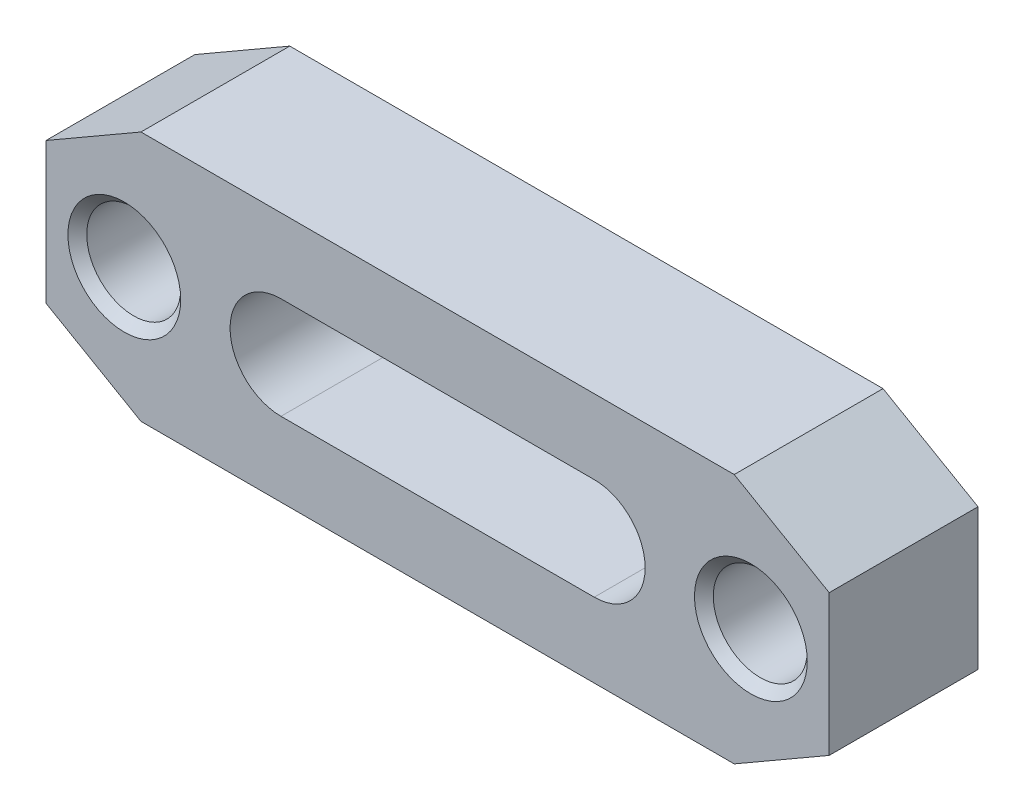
ISO-10303-21;
HEADER;
FILE_DESCRIPTION(('STEP AP214'),'2;1');
FILE_NAME('part.step','',(''),(''),'','','');
FILE_SCHEMA(('AUTOMOTIVE_DESIGN { 1 0 10303 214 1 1 1 1 }'));
ENDSEC;
DATA;
#1=APPLICATION_CONTEXT('core data for automotive mechanical design processes');
#2=APPLICATION_PROTOCOL_DEFINITION('international standard','automotive_design',2000,#1);
#3=PRODUCT_CONTEXT('',#1,'mechanical');
#4=PRODUCT('Part','Part','',(#3));
#5=PRODUCT_RELATED_PRODUCT_CATEGORY('part','',(#4));
#6=PRODUCT_DEFINITION_FORMATION('','',#4);
#7=PRODUCT_DEFINITION_CONTEXT('part definition',#1,'design');
#8=PRODUCT_DEFINITION('design','',#6,#7);
#9=PRODUCT_DEFINITION_SHAPE('','',#8);
#10=(LENGTH_UNIT() NAMED_UNIT(*) SI_UNIT(.MILLI.,.METRE.));
#11=(NAMED_UNIT(*) PLANE_ANGLE_UNIT() SI_UNIT($,.RADIAN.));
#12=(NAMED_UNIT(*) SI_UNIT($,.STERADIAN.) SOLID_ANGLE_UNIT());
#13=UNCERTAINTY_MEASURE_WITH_UNIT(LENGTH_MEASURE(1.E-05),#10,'distance_accuracy_value','');
#14=(GEOMETRIC_REPRESENTATION_CONTEXT(3) GLOBAL_UNCERTAINTY_ASSIGNED_CONTEXT((#13)) GLOBAL_UNIT_ASSIGNED_CONTEXT((#10,
#11,#12)) REPRESENTATION_CONTEXT('',''));
#15=CARTESIAN_POINT('',(0.,0.,0.));
#16=DIRECTION('',(0.,0.,1.));
#17=DIRECTION('',(1.,0.,0.));
#18=AXIS2_PLACEMENT_3D('',#15,#16,#17);
#19=CARTESIAN_POINT('',(50.,-16.,19.));
#20=DIRECTION('',(0.,0.,1.));
#21=DIRECTION('',(1.,0.,0.));
#22=AXIS2_PLACEMENT_3D('',#19,#20,#21);
#23=PLANE('',#22);
#24=CARTESIAN_POINT('',(40.,0.,19.));
#25=DIRECTION('',(0.,0.,-1.));
#26=DIRECTION('',(-1.,0.,0.));
#27=AXIS2_PLACEMENT_3D('',#24,#25,#26);
#28=CIRCLE('',#27,7.2);
#29=CARTESIAN_POINT('',(32.8,0.,19.));
#30=VERTEX_POINT('',#29);
#31=EDGE_CURVE('E212',#30,#30,#28,.T.);
#32=ORIENTED_EDGE('',*,*,#31,.T.);
#33=EDGE_LOOP('',(#32));
#34=FACE_BOUND('',#33,.T.);
#35=CARTESIAN_POINT('',(-40.,0.,19.));
#36=DIRECTION('',(0.,0.,-1.));
#37=DIRECTION('',(-1.,0.,0.));
#38=AXIS2_PLACEMENT_3D('',#35,#36,#37);
#39=CIRCLE('',#38,7.2);
#40=CARTESIAN_POINT('',(-47.2,0.,19.));
#41=VERTEX_POINT('',#40);
#42=EDGE_CURVE('E133',#41,#41,#39,.T.);
#43=ORIENTED_EDGE('',*,*,#42,.T.);
#44=EDGE_LOOP('',(#43));
#45=FACE_BOUND('',#44,.T.);
#46=DIRECTION('',(1.,0.,0.));
#47=VECTOR('',#46,1.);
#48=CARTESIAN_POINT('',(-37.8756443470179,-16.,19.));
#49=LINE('',#48,#47);
#50=CARTESIAN_POINT('',(-37.8756443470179,-16.,19.));
#51=VERTEX_POINT('',#50);
#52=CARTESIAN_POINT('',(37.8756443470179,-16.,19.));
#53=VERTEX_POINT('',#52);
#54=EDGE_CURVE('E143',#51,#53,#49,.T.);
#55=ORIENTED_EDGE('',*,*,#54,.T.);
#56=DIRECTION('',(0.866025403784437,0.5,0.));
#57=VECTOR('',#56,1.);
#58=CARTESIAN_POINT('',(37.8756443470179,-16.,19.));
#59=LINE('',#58,#57);
#60=CARTESIAN_POINT('',(50.,-9.,19.));
#61=VERTEX_POINT('',#60);
#62=EDGE_CURVE('E146',#53,#61,#59,.T.);
#63=ORIENTED_EDGE('',*,*,#62,.T.);
#64=DIRECTION('',(0.,1.,0.));
#65=VECTOR('',#64,1.);
#66=CARTESIAN_POINT('',(50.,-9.,19.));
#67=LINE('',#66,#65);
#68=CARTESIAN_POINT('',(50.,9.,19.));
#69=VERTEX_POINT('',#68);
#70=EDGE_CURVE('E149',#61,#69,#67,.T.);
#71=ORIENTED_EDGE('',*,*,#70,.T.);
#72=DIRECTION('',(-0.866025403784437,0.5,0.));
#73=VECTOR('',#72,1.);
#74=CARTESIAN_POINT('',(37.8756443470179,16.,19.));
#75=LINE('',#74,#73);
#76=CARTESIAN_POINT('',(37.8756443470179,16.,19.));
#77=VERTEX_POINT('',#76);
#78=EDGE_CURVE('E151',#69,#77,#75,.T.);
#79=ORIENTED_EDGE('',*,*,#78,.T.);
#80=DIRECTION('',(-1.,0.,0.));
#81=VECTOR('',#80,1.);
#82=CARTESIAN_POINT('',(-37.8756443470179,16.,19.));
#83=LINE('',#82,#81);
#84=CARTESIAN_POINT('',(-37.8756443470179,16.,19.));
#85=VERTEX_POINT('',#84);
#86=EDGE_CURVE('E153',#77,#85,#83,.T.);
#87=ORIENTED_EDGE('',*,*,#86,.T.);
#88=DIRECTION('',(-0.866025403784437,-0.5,0.));
#89=VECTOR('',#88,1.);
#90=CARTESIAN_POINT('',(-37.8756443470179,16.,19.));
#91=LINE('',#90,#89);
#92=CARTESIAN_POINT('',(-50.,9.,19.));
#93=VERTEX_POINT('',#92);
#94=EDGE_CURVE('E155',#85,#93,#91,.T.);
#95=ORIENTED_EDGE('',*,*,#94,.T.);
#96=DIRECTION('',(0.,-1.,0.));
#97=VECTOR('',#96,1.);
#98=CARTESIAN_POINT('',(-50.,-9.,19.));
#99=LINE('',#98,#97);
#100=CARTESIAN_POINT('',(-50.,-9.,19.));
#101=VERTEX_POINT('',#100);
#102=EDGE_CURVE('E157',#93,#101,#99,.T.);
#103=ORIENTED_EDGE('',*,*,#102,.T.);
#104=DIRECTION('',(0.866025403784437,-0.5,0.));
#105=VECTOR('',#104,1.);
#106=CARTESIAN_POINT('',(-37.8756443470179,-16.,19.));
#107=LINE('',#106,#105);
#108=EDGE_CURVE('E159',#101,#51,#107,.T.);
#109=ORIENTED_EDGE('',*,*,#108,.T.);
#110=EDGE_LOOP('',(#55,#63,#71,#79,#87,#95,#103,#109));
#111=FACE_BOUND('',#110,.T.);
#112=DIRECTION('',(-1.,0.,0.));
#113=VECTOR('',#112,1.);
#114=CARTESIAN_POINT('',(20.,6.5,19.));
#115=LINE('',#114,#113);
#116=CARTESIAN_POINT('',(20.,6.5,19.));
#117=VERTEX_POINT('',#116);
#118=CARTESIAN_POINT('',(-20.,6.5,19.));
#119=VERTEX_POINT('',#118);
#120=EDGE_CURVE('E113',#117,#119,#115,.T.);
#121=ORIENTED_EDGE('',*,*,#120,.F.);
#122=CARTESIAN_POINT('',(20.,0.,19.));
#123=DIRECTION('',(0.,0.,1.));
#124=DIRECTION('',(1.,0.,0.));
#125=AXIS2_PLACEMENT_3D('',#122,#123,#124);
#126=CIRCLE('',#125,6.5);
#127=CARTESIAN_POINT('',(20.,-6.5,19.));
#128=VERTEX_POINT('',#127);
#129=EDGE_CURVE('E105',#128,#117,#126,.T.);
#130=ORIENTED_EDGE('',*,*,#129,.F.);
#131=DIRECTION('',(1.,0.,0.));
#132=VECTOR('',#131,1.);
#133=CARTESIAN_POINT('',(20.,-6.5,19.));
#134=LINE('',#133,#132);
#135=CARTESIAN_POINT('',(-20.,-6.5,19.));
#136=VERTEX_POINT('',#135);
#137=EDGE_CURVE('E127',#136,#128,#134,.T.);
#138=ORIENTED_EDGE('',*,*,#137,.F.);
#139=CARTESIAN_POINT('',(-20.,0.,19.));
#140=DIRECTION('',(0.,0.,1.));
#141=DIRECTION('',(1.,0.,0.));
#142=AXIS2_PLACEMENT_3D('',#139,#140,#141);
#143=CIRCLE('',#142,6.5);
#144=EDGE_CURVE('E125',#119,#136,#143,.T.);
#145=ORIENTED_EDGE('',*,*,#144,.F.);
#146=EDGE_LOOP('',(#121,#130,#138,#145));
#147=FACE_BOUND('',#146,.T.);
#148=ADVANCED_FACE('F14',(#34,#45,#111,#147),#23,.T.);
#149=CARTESIAN_POINT('',(50.,-16.,0.));
#150=DIRECTION('',(0.,0.,1.));
#151=DIRECTION('',(1.,0.,0.));
#152=AXIS2_PLACEMENT_3D('',#149,#150,#151);
#153=PLANE('',#152);
#154=CARTESIAN_POINT('',(40.,0.,0.));
#155=DIRECTION('',(0.,0.,-1.));
#156=DIRECTION('',(-1.,0.,0.));
#157=AXIS2_PLACEMENT_3D('',#154,#155,#156);
#158=CIRCLE('',#157,7.2);
#159=CARTESIAN_POINT('',(32.8,0.,0.));
#160=VERTEX_POINT('',#159);
#161=EDGE_CURVE('E202',#160,#160,#158,.T.);
#162=ORIENTED_EDGE('',*,*,#161,.F.);
#163=EDGE_LOOP('',(#162));
#164=FACE_BOUND('',#163,.T.);
#165=CARTESIAN_POINT('',(-40.,0.,0.));
#166=DIRECTION('',(0.,0.,-1.));
#167=DIRECTION('',(-1.,0.,0.));
#168=AXIS2_PLACEMENT_3D('',#165,#166,#167);
#169=CIRCLE('',#168,7.2);
#170=CARTESIAN_POINT('',(-47.2,0.,0.));
#171=VERTEX_POINT('',#170);
#172=EDGE_CURVE('E215',#171,#171,#169,.T.);
#173=ORIENTED_EDGE('',*,*,#172,.F.);
#174=EDGE_LOOP('',(#173));
#175=FACE_BOUND('',#174,.T.);
#176=DIRECTION('',(1.,0.,0.));
#177=VECTOR('',#176,1.);
#178=CARTESIAN_POINT('',(-37.8756443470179,-16.,0.));
#179=LINE('',#178,#177);
#180=CARTESIAN_POINT('',(-37.8756443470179,-16.,0.));
#181=VERTEX_POINT('',#180);
#182=CARTESIAN_POINT('',(37.8756443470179,-16.,0.));
#183=VERTEX_POINT('',#182);
#184=EDGE_CURVE('E121',#181,#183,#179,.T.);
#185=ORIENTED_EDGE('',*,*,#184,.F.);
#186=DIRECTION('',(0.866025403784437,-0.5,0.));
#187=VECTOR('',#186,1.);
#188=CARTESIAN_POINT('',(-37.8756443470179,-16.,0.));
#189=LINE('',#188,#187);
#190=CARTESIAN_POINT('',(-50.,-9.,0.));
#191=VERTEX_POINT('',#190);
#192=EDGE_CURVE('E147',#191,#181,#189,.T.);
#193=ORIENTED_EDGE('',*,*,#192,.F.);
#194=DIRECTION('',(0.,-1.,0.));
#195=VECTOR('',#194,1.);
#196=CARTESIAN_POINT('',(-50.,-9.,0.));
#197=LINE('',#196,#195);
#198=CARTESIAN_POINT('',(-50.,9.,0.));
#199=VERTEX_POINT('',#198);
#200=EDGE_CURVE('E174',#199,#191,#197,.T.);
#201=ORIENTED_EDGE('',*,*,#200,.F.);
#202=DIRECTION('',(-0.866025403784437,-0.5,0.));
#203=VECTOR('',#202,1.);
#204=CARTESIAN_POINT('',(-37.8756443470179,16.,0.));
#205=LINE('',#204,#203);
#206=CARTESIAN_POINT('',(-37.8756443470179,16.,0.));
#207=VERTEX_POINT('',#206);
#208=EDGE_CURVE('E172',#207,#199,#205,.T.);
#209=ORIENTED_EDGE('',*,*,#208,.F.);
#210=DIRECTION('',(-1.,0.,0.));
#211=VECTOR('',#210,1.);
#212=CARTESIAN_POINT('',(-37.8756443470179,16.,0.));
#213=LINE('',#212,#211);
#214=CARTESIAN_POINT('',(37.8756443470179,16.,0.));
#215=VERTEX_POINT('',#214);
#216=EDGE_CURVE('E170',#215,#207,#213,.T.);
#217=ORIENTED_EDGE('',*,*,#216,.F.);
#218=DIRECTION('',(-0.866025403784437,0.5,0.));
#219=VECTOR('',#218,1.);
#220=CARTESIAN_POINT('',(37.8756443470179,16.,0.));
#221=LINE('',#220,#219);
#222=CARTESIAN_POINT('',(50.,9.,0.));
#223=VERTEX_POINT('',#222);
#224=EDGE_CURVE('E168',#223,#215,#221,.T.);
#225=ORIENTED_EDGE('',*,*,#224,.F.);
#226=DIRECTION('',(0.,1.,0.));
#227=VECTOR('',#226,1.);
#228=CARTESIAN_POINT('',(50.,-9.,0.));
#229=LINE('',#228,#227);
#230=CARTESIAN_POINT('',(50.,-9.,0.));
#231=VERTEX_POINT('',#230);
#232=EDGE_CURVE('E166',#231,#223,#229,.T.);
#233=ORIENTED_EDGE('',*,*,#232,.F.);
#234=DIRECTION('',(0.866025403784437,0.5,0.));
#235=VECTOR('',#234,1.);
#236=CARTESIAN_POINT('',(37.8756443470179,-16.,0.));
#237=LINE('',#236,#235);
#238=EDGE_CURVE('E164',#183,#231,#237,.T.);
#239=ORIENTED_EDGE('',*,*,#238,.F.);
#240=EDGE_LOOP('',(#185,#193,#201,#209,#217,#225,#233,#239));
#241=FACE_BOUND('',#240,.T.);
#242=CARTESIAN_POINT('',(20.,0.,0.));
#243=DIRECTION('',(0.,0.,1.));
#244=DIRECTION('',(1.,0.,0.));
#245=AXIS2_PLACEMENT_3D('',#242,#243,#244);
#246=CIRCLE('',#245,6.5);
#247=CARTESIAN_POINT('',(20.,-6.5,0.));
#248=VERTEX_POINT('',#247);
#249=CARTESIAN_POINT('',(20.,6.5,0.));
#250=VERTEX_POINT('',#249);
#251=EDGE_CURVE('E39',#248,#250,#246,.T.);
#252=ORIENTED_EDGE('',*,*,#251,.T.);
#253=DIRECTION('',(-1.,0.,0.));
#254=VECTOR('',#253,1.);
#255=CARTESIAN_POINT('',(20.,6.5,0.));
#256=LINE('',#255,#254);
#257=CARTESIAN_POINT('',(-20.,6.5,0.));
#258=VERTEX_POINT('',#257);
#259=EDGE_CURVE('E120',#250,#258,#256,.T.);
#260=ORIENTED_EDGE('',*,*,#259,.T.);
#261=CARTESIAN_POINT('',(-20.,0.,0.));
#262=DIRECTION('',(0.,0.,1.));
#263=DIRECTION('',(1.,0.,0.));
#264=AXIS2_PLACEMENT_3D('',#261,#262,#263);
#265=CIRCLE('',#264,6.5);
#266=CARTESIAN_POINT('',(-20.,-6.5,0.));
#267=VERTEX_POINT('',#266);
#268=EDGE_CURVE('E135',#258,#267,#265,.T.);
#269=ORIENTED_EDGE('',*,*,#268,.T.);
#270=DIRECTION('',(1.,0.,0.));
#271=VECTOR('',#270,1.);
#272=CARTESIAN_POINT('',(20.,-6.5,0.));
#273=LINE('',#272,#271);
#274=EDGE_CURVE('E114',#267,#248,#273,.T.);
#275=ORIENTED_EDGE('',*,*,#274,.T.);
#276=EDGE_LOOP('',(#252,#260,#269,#275));
#277=FACE_BOUND('',#276,.T.);
#278=ADVANCED_FACE('F238',(#164,#175,#241,#277),#153,.F.);
#279=CARTESIAN_POINT('',(-37.8756443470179,-16.,19.));
#280=DIRECTION('',(0.,1.,0.));
#281=DIRECTION('',(-1.,0.,0.));
#282=AXIS2_PLACEMENT_3D('',#279,#280,#281);
#283=PLANE('',#282);
#284=ORIENTED_EDGE('',*,*,#184,.T.);
#285=DIRECTION('',(0.,0.,-1.));
#286=VECTOR('',#285,1.);
#287=CARTESIAN_POINT('',(37.8756443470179,-16.,19.));
#288=LINE('',#287,#286);
#289=EDGE_CURVE('E9',#53,#183,#288,.T.);
#290=ORIENTED_EDGE('',*,*,#289,.F.);
#291=ORIENTED_EDGE('',*,*,#54,.F.);
#292=DIRECTION('',(0.,0.,-1.));
#293=VECTOR('',#292,1.);
#294=CARTESIAN_POINT('',(-37.8756443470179,-16.,19.));
#295=LINE('',#294,#293);
#296=EDGE_CURVE('E161',#51,#181,#295,.T.);
#297=ORIENTED_EDGE('',*,*,#296,.T.);
#298=EDGE_LOOP('',(#284,#290,#291,#297));
#299=FACE_BOUND('',#298,.T.);
#300=ADVANCED_FACE('F16',(#299),#283,.F.);
#301=CARTESIAN_POINT('',(37.8756443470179,-16.,19.));
#302=DIRECTION('',(-0.5,0.866025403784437,0.));
#303=DIRECTION('',(-0.866025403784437,-0.5,0.));
#304=AXIS2_PLACEMENT_3D('',#301,#302,#303);
#305=PLANE('',#304);
#306=ORIENTED_EDGE('',*,*,#238,.T.);
#307=DIRECTION('',(0.,0.,-1.));
#308=VECTOR('',#307,1.);
#309=CARTESIAN_POINT('',(50.,-9.,19.));
#310=LINE('',#309,#308);
#311=EDGE_CURVE('E23',#61,#231,#310,.T.);
#312=ORIENTED_EDGE('',*,*,#311,.F.);
#313=ORIENTED_EDGE('',*,*,#62,.F.);
#314=ORIENTED_EDGE('',*,*,#289,.T.);
#315=EDGE_LOOP('',(#306,#312,#313,#314));
#316=FACE_BOUND('',#315,.T.);
#317=ADVANCED_FACE('F271',(#316),#305,.F.);
#318=CARTESIAN_POINT('',(50.,-9.,19.));
#319=DIRECTION('',(-1.,0.,0.));
#320=DIRECTION('',(0.,0.,1.));
#321=AXIS2_PLACEMENT_3D('',#318,#319,#320);
#322=PLANE('',#321);
#323=ORIENTED_EDGE('',*,*,#232,.T.);
#324=DIRECTION('',(0.,0.,-1.));
#325=VECTOR('',#324,1.);
#326=CARTESIAN_POINT('',(50.,9.,19.));
#327=LINE('',#326,#325);
#328=EDGE_CURVE('E191',#69,#223,#327,.T.);
#329=ORIENTED_EDGE('',*,*,#328,.F.);
#330=ORIENTED_EDGE('',*,*,#70,.F.);
#331=ORIENTED_EDGE('',*,*,#311,.T.);
#332=EDGE_LOOP('',(#323,#329,#330,#331));
#333=FACE_BOUND('',#332,.T.);
#334=ADVANCED_FACE('F268',(#333),#322,.F.);
#335=CARTESIAN_POINT('',(37.8756443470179,16.,19.));
#336=DIRECTION('',(-0.5,-0.866025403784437,0.));
#337=DIRECTION('',(0.866025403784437,-0.5,0.));
#338=AXIS2_PLACEMENT_3D('',#335,#336,#337);
#339=PLANE('',#338);
#340=ORIENTED_EDGE('',*,*,#224,.T.);
#341=DIRECTION('',(0.,0.,-1.));
#342=VECTOR('',#341,1.);
#343=CARTESIAN_POINT('',(37.8756443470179,16.,19.));
#344=LINE('',#343,#342);
#345=EDGE_CURVE('E188',#77,#215,#344,.T.);
#346=ORIENTED_EDGE('',*,*,#345,.F.);
#347=ORIENTED_EDGE('',*,*,#78,.F.);
#348=ORIENTED_EDGE('',*,*,#328,.T.);
#349=EDGE_LOOP('',(#340,#346,#347,#348));
#350=FACE_BOUND('',#349,.T.);
#351=ADVANCED_FACE('F264',(#350),#339,.F.);
#352=CARTESIAN_POINT('',(-37.8756443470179,16.,19.));
#353=DIRECTION('',(0.,-1.,0.));
#354=DIRECTION('',(0.,0.,-1.));
#355=AXIS2_PLACEMENT_3D('',#352,#353,#354);
#356=PLANE('',#355);
#357=ORIENTED_EDGE('',*,*,#216,.T.);
#358=DIRECTION('',(0.,0.,-1.));
#359=VECTOR('',#358,1.);
#360=CARTESIAN_POINT('',(-37.8756443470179,16.,19.));
#361=LINE('',#360,#359);
#362=EDGE_CURVE('E185',#85,#207,#361,.T.);
#363=ORIENTED_EDGE('',*,*,#362,.F.);
#364=ORIENTED_EDGE('',*,*,#86,.F.);
#365=ORIENTED_EDGE('',*,*,#345,.T.);
#366=EDGE_LOOP('',(#357,#363,#364,#365));
#367=FACE_BOUND('',#366,.T.);
#368=ADVANCED_FACE('F260',(#367),#356,.F.);
#369=CARTESIAN_POINT('',(-37.8756443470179,16.,19.));
#370=DIRECTION('',(0.5,-0.866025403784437,0.));
#371=DIRECTION('',(0.866025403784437,0.5,0.));
#372=AXIS2_PLACEMENT_3D('',#369,#370,#371);
#373=PLANE('',#372);
#374=ORIENTED_EDGE('',*,*,#208,.T.);
#375=DIRECTION('',(0.,0.,-1.));
#376=VECTOR('',#375,1.);
#377=CARTESIAN_POINT('',(-50.,9.,19.));
#378=LINE('',#377,#376);
#379=EDGE_CURVE('E182',#93,#199,#378,.T.);
#380=ORIENTED_EDGE('',*,*,#379,.F.);
#381=ORIENTED_EDGE('',*,*,#94,.F.);
#382=ORIENTED_EDGE('',*,*,#362,.T.);
#383=EDGE_LOOP('',(#374,#380,#381,#382));
#384=FACE_BOUND('',#383,.T.);
#385=ADVANCED_FACE('F256',(#384),#373,.F.);
#386=CARTESIAN_POINT('',(-50.,-9.,19.));
#387=DIRECTION('',(1.,0.,0.));
#388=DIRECTION('',(0.,0.,-1.));
#389=AXIS2_PLACEMENT_3D('',#386,#387,#388);
#390=PLANE('',#389);
#391=ORIENTED_EDGE('',*,*,#200,.T.);
#392=DIRECTION('',(0.,0.,-1.));
#393=VECTOR('',#392,1.);
#394=CARTESIAN_POINT('',(-50.,-9.,19.));
#395=LINE('',#394,#393);
#396=EDGE_CURVE('E179',#101,#191,#395,.T.);
#397=ORIENTED_EDGE('',*,*,#396,.F.);
#398=ORIENTED_EDGE('',*,*,#102,.F.);
#399=ORIENTED_EDGE('',*,*,#379,.T.);
#400=EDGE_LOOP('',(#391,#397,#398,#399));
#401=FACE_BOUND('',#400,.T.);
#402=ADVANCED_FACE('F252',(#401),#390,.F.);
#403=CARTESIAN_POINT('',(-37.8756443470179,-16.,19.));
#404=DIRECTION('',(0.5,0.866025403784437,0.));
#405=DIRECTION('',(-0.866025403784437,0.5,0.));
#406=AXIS2_PLACEMENT_3D('',#403,#404,#405);
#407=PLANE('',#406);
#408=ORIENTED_EDGE('',*,*,#192,.T.);
#409=ORIENTED_EDGE('',*,*,#296,.F.);
#410=ORIENTED_EDGE('',*,*,#108,.F.);
#411=ORIENTED_EDGE('',*,*,#396,.T.);
#412=EDGE_LOOP('',(#408,#409,#410,#411));
#413=FACE_BOUND('',#412,.T.);
#414=ADVANCED_FACE('F249',(#413),#407,.F.);
#415=CARTESIAN_POINT('',(20.,0.,19.));
#416=DIRECTION('',(0.,0.,-1.));
#417=DIRECTION('',(-1.,0.,0.));
#418=AXIS2_PLACEMENT_3D('',#415,#416,#417);
#419=CYLINDRICAL_SURFACE('',#418,6.5);
#420=ORIENTED_EDGE('',*,*,#251,.F.);
#421=DIRECTION('',(0.,0.,-1.));
#422=VECTOR('',#421,1.);
#423=CARTESIAN_POINT('',(20.,-6.5,19.));
#424=LINE('',#423,#422);
#425=EDGE_CURVE('E109',#128,#248,#424,.T.);
#426=ORIENTED_EDGE('',*,*,#425,.F.);
#427=ORIENTED_EDGE('',*,*,#129,.T.);
#428=DIRECTION('',(0.,0.,-1.));
#429=VECTOR('',#428,1.);
#430=CARTESIAN_POINT('',(20.,6.5,19.));
#431=LINE('',#430,#429);
#432=EDGE_CURVE('E108',#117,#250,#431,.T.);
#433=ORIENTED_EDGE('',*,*,#432,.T.);
#434=EDGE_LOOP('',(#420,#426,#427,#433));
#435=FACE_BOUND('',#434,.T.);
#436=ADVANCED_FACE('F107',(#435),#419,.F.);
#437=CARTESIAN_POINT('',(20.,6.5,19.));
#438=DIRECTION('',(0.,-1.,0.));
#439=DIRECTION('',(1.,0.,0.));
#440=AXIS2_PLACEMENT_3D('',#437,#438,#439);
#441=PLANE('',#440);
#442=ORIENTED_EDGE('',*,*,#259,.F.);
#443=ORIENTED_EDGE('',*,*,#432,.F.);
#444=ORIENTED_EDGE('',*,*,#120,.T.);
#445=DIRECTION('',(0.,0.,-1.));
#446=VECTOR('',#445,1.);
#447=CARTESIAN_POINT('',(-20.,6.5,19.));
#448=LINE('',#447,#446);
#449=EDGE_CURVE('E122',#119,#258,#448,.T.);
#450=ORIENTED_EDGE('',*,*,#449,.T.);
#451=EDGE_LOOP('',(#442,#443,#444,#450));
#452=FACE_BOUND('',#451,.T.);
#453=ADVANCED_FACE('F117',(#452),#441,.T.);
#454=CARTESIAN_POINT('',(-20.,0.,19.));
#455=DIRECTION('',(0.,0.,-1.));
#456=DIRECTION('',(-1.,0.,0.));
#457=AXIS2_PLACEMENT_3D('',#454,#455,#456);
#458=CYLINDRICAL_SURFACE('',#457,6.5);
#459=ORIENTED_EDGE('',*,*,#268,.F.);
#460=ORIENTED_EDGE('',*,*,#449,.F.);
#461=ORIENTED_EDGE('',*,*,#144,.T.);
#462=DIRECTION('',(0.,0.,-1.));
#463=VECTOR('',#462,1.);
#464=CARTESIAN_POINT('',(-20.,-6.5,19.));
#465=LINE('',#464,#463);
#466=EDGE_CURVE('E31',#136,#267,#465,.T.);
#467=ORIENTED_EDGE('',*,*,#466,.T.);
#468=EDGE_LOOP('',(#459,#460,#461,#467));
#469=FACE_BOUND('',#468,.T.);
#470=ADVANCED_FACE('F235',(#469),#458,.F.);
#471=CARTESIAN_POINT('',(20.,-6.5,19.));
#472=DIRECTION('',(0.,1.,0.));
#473=DIRECTION('',(-1.,0.,0.));
#474=AXIS2_PLACEMENT_3D('',#471,#472,#473);
#475=PLANE('',#474);
#476=ORIENTED_EDGE('',*,*,#274,.F.);
#477=ORIENTED_EDGE('',*,*,#466,.F.);
#478=ORIENTED_EDGE('',*,*,#137,.T.);
#479=ORIENTED_EDGE('',*,*,#425,.T.);
#480=EDGE_LOOP('',(#476,#477,#478,#479));
#481=FACE_BOUND('',#480,.T.);
#482=ADVANCED_FACE('F225',(#481),#475,.T.);
#483=CARTESIAN_POINT('',(-40.,0.,17.));
#484=DIRECTION('',(0.,0.,1.));
#485=DIRECTION('',(1.,0.,0.));
#486=AXIS2_PLACEMENT_3D('',#483,#484,#485);
#487=CONICAL_SURFACE('',#486,5.2,0.785398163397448);
#488=CARTESIAN_POINT('',(-40.,0.,17.8));
#489=DIRECTION('',(0.,0.,1.));
#490=DIRECTION('',(1.,0.,0.));
#491=AXIS2_PLACEMENT_3D('',#488,#489,#490);
#492=CIRCLE('',#491,6.);
#493=CARTESIAN_POINT('',(-34.,0.,17.8));
#494=VERTEX_POINT('',#493);
#495=EDGE_CURVE('E197',#494,#494,#492,.F.);
#496=ORIENTED_EDGE('',*,*,#495,.T.);
#497=EDGE_LOOP('',(#496));
#498=FACE_BOUND('',#497,.T.);
#499=ORIENTED_EDGE('',*,*,#42,.F.);
#500=EDGE_LOOP('',(#499));
#501=FACE_BOUND('',#500,.T.);
#502=ADVANCED_FACE('F222',(#498,#501),#487,.F.);
#503=CARTESIAN_POINT('',(-40.,0.,0.));
#504=DIRECTION('',(0.,0.,-1.));
#505=DIRECTION('',(-1.,0.,0.));
#506=AXIS2_PLACEMENT_3D('',#503,#504,#505);
#507=CONICAL_SURFACE('',#506,7.2,0.785398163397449);
#508=CARTESIAN_POINT('',(-40.,0.,1.2));
#509=DIRECTION('',(0.,0.,-1.));
#510=DIRECTION('',(-1.,0.,0.));
#511=AXIS2_PLACEMENT_3D('',#508,#509,#510);
#512=CIRCLE('',#511,6.);
#513=CARTESIAN_POINT('',(-46.,0.,1.2));
#514=VERTEX_POINT('',#513);
#515=EDGE_CURVE('E195',#514,#514,#512,.F.);
#516=ORIENTED_EDGE('',*,*,#515,.T.);
#517=EDGE_LOOP('',(#516));
#518=FACE_BOUND('',#517,.T.);
#519=ORIENTED_EDGE('',*,*,#172,.T.);
#520=EDGE_LOOP('',(#519));
#521=FACE_BOUND('',#520,.T.);
#522=ADVANCED_FACE('F224',(#518,#521),#507,.F.);
#523=CARTESIAN_POINT('',(40.,0.,17.));
#524=DIRECTION('',(0.,0.,1.));
#525=DIRECTION('',(1.,0.,0.));
#526=AXIS2_PLACEMENT_3D('',#523,#524,#525);
#527=CONICAL_SURFACE('',#526,5.2,0.785398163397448);
#528=CARTESIAN_POINT('',(40.,0.,17.8));
#529=DIRECTION('',(0.,0.,1.));
#530=DIRECTION('',(1.,0.,0.));
#531=AXIS2_PLACEMENT_3D('',#528,#529,#530);
#532=CIRCLE('',#531,6.);
#533=CARTESIAN_POINT('',(46.,0.,17.8));
#534=VERTEX_POINT('',#533);
#535=EDGE_CURVE('E198',#534,#534,#532,.F.);
#536=ORIENTED_EDGE('',*,*,#535,.T.);
#537=EDGE_LOOP('',(#536));
#538=FACE_BOUND('',#537,.T.);
#539=ORIENTED_EDGE('',*,*,#31,.F.);
#540=EDGE_LOOP('',(#539));
#541=FACE_BOUND('',#540,.T.);
#542=ADVANCED_FACE('F233',(#538,#541),#527,.F.);
#543=CARTESIAN_POINT('',(40.,0.,0.));
#544=DIRECTION('',(0.,0.,-1.));
#545=DIRECTION('',(-1.,0.,0.));
#546=AXIS2_PLACEMENT_3D('',#543,#544,#545);
#547=CONICAL_SURFACE('',#546,7.2,0.785398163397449);
#548=CARTESIAN_POINT('',(40.,0.,1.2));
#549=DIRECTION('',(0.,0.,-1.));
#550=DIRECTION('',(-1.,0.,0.));
#551=AXIS2_PLACEMENT_3D('',#548,#549,#550);
#552=CIRCLE('',#551,6.);
#553=CARTESIAN_POINT('',(34.,0.,1.2));
#554=VERTEX_POINT('',#553);
#555=EDGE_CURVE('E18',#554,#554,#552,.F.);
#556=ORIENTED_EDGE('',*,*,#555,.T.);
#557=EDGE_LOOP('',(#556));
#558=FACE_BOUND('',#557,.T.);
#559=ORIENTED_EDGE('',*,*,#161,.T.);
#560=EDGE_LOOP('',(#559));
#561=FACE_BOUND('',#560,.T.);
#562=ADVANCED_FACE('F398',(#558,#561),#547,.F.);
#563=CARTESIAN_POINT('',(-40.,0.,0.));
#564=DIRECTION('',(0.,0.,1.));
#565=DIRECTION('',(1.,0.,0.));
#566=AXIS2_PLACEMENT_3D('',#563,#564,#565);
#567=CYLINDRICAL_SURFACE('',#566,6.);
#568=ORIENTED_EDGE('',*,*,#515,.F.);
#569=EDGE_LOOP('',(#568));
#570=FACE_BOUND('',#569,.T.);
#571=ORIENTED_EDGE('',*,*,#495,.F.);
#572=EDGE_LOOP('',(#571));
#573=FACE_BOUND('',#572,.T.);
#574=ADVANCED_FACE('F407',(#570,#573),#567,.F.);
#575=CARTESIAN_POINT('',(40.,0.,0.));
#576=DIRECTION('',(0.,0.,1.));
#577=DIRECTION('',(1.,0.,0.));
#578=AXIS2_PLACEMENT_3D('',#575,#576,#577);
#579=CYLINDRICAL_SURFACE('',#578,6.);
#580=ORIENTED_EDGE('',*,*,#555,.F.);
#581=EDGE_LOOP('',(#580));
#582=FACE_BOUND('',#581,.T.);
#583=ORIENTED_EDGE('',*,*,#535,.F.);
#584=EDGE_LOOP('',(#583));
#585=FACE_BOUND('',#584,.T.);
#586=ADVANCED_FACE('F417',(#582,#585),#579,.F.);
#587=CLOSED_SHELL('',(#148,#278,#300,#317,#334,#351,#368,#385,#402,#414,#436,#453,#470,#482,
#502,#522,#542,#562,#574,#586));
#588=MANIFOLD_SOLID_BREP('B1',#587);
#589=ADVANCED_BREP_SHAPE_REPRESENTATION('',(#18,#588),#14);
#590=SHAPE_DEFINITION_REPRESENTATION(#9,#589);
ENDSEC;
END-ISO-10303-21;
